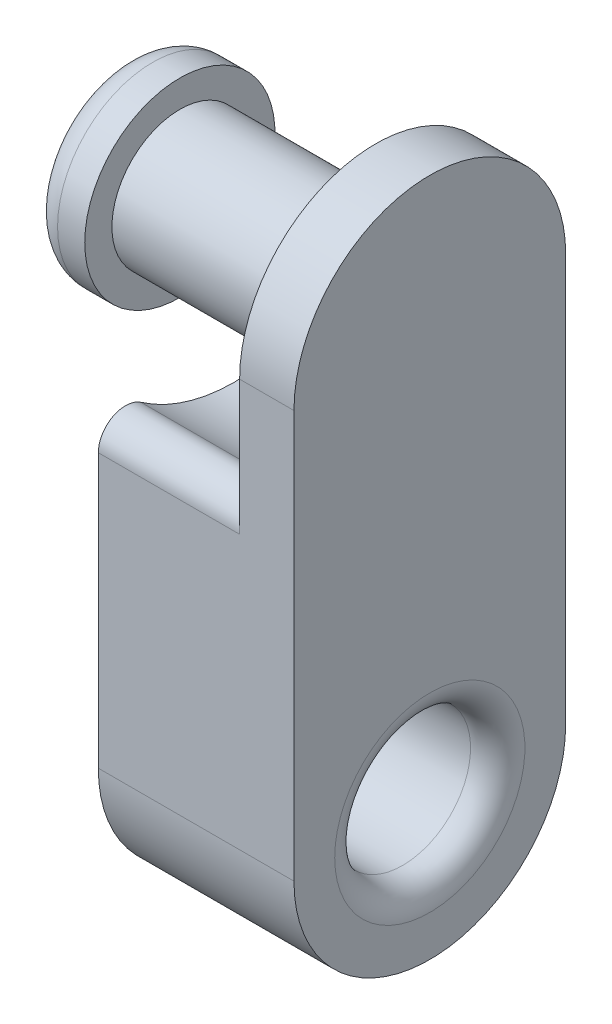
from build123d import *

# Parameters (mm, degrees)
SKETCH1_R           = 3.175
BOSS_EXTRUDE1_DEPTH = 2.54
BOSS_EXTRUDE2_START = -6.604
SKETCH1_4_R         = 3.175
BOSS_EXTRUDE2_DEPTH = 6.604
BOSS_EXTRUDE5_START = 2.54
SKETCH3_R           = 3.175
BOSS_EXTRUDE5_DEPTH = 2.54
BOSS_EXTRUDE6_START = 2.54
SKETCH3_3_R         = 4.445
BOSS_EXTRUDE6_DEPTH = 2.54
FILLET2_R           = 1.27


with BuildPart() as part:
    # Sketch1 → Boss-Extrude1 (new body)
    with BuildSketch(Plane(origin=(0, 0, 0), x_dir=(0, 0, -1), z_dir=(1, 0, 0))):
        with BuildLine():
            Line((-6.35, 0), (-6.35, 19.05))
            ThreePointArc((-6.35, 19.05), (0, 25.4), (6.35, 19.05))
            Line((6.35, 19.05), (6.35, 0))
            ThreePointArc((6.35, 0), (0, -6.35), (-6.35, 0))
        make_face()
        Circle(SKETCH1_R, mode=Mode.SUBTRACT)
    extrude(amount=BOSS_EXTRUDE1_DEPTH)

    # Sketch1_4 → Boss-Extrude2 (add)
    # profile 1 of 2: a face of its own
    with BuildSketch(Plane(origin=(0, 0, 0), x_dir=(0, 0, -1), z_dir=(1, 0, 0)).offset(BOSS_EXTRUDE2_START)):
        with BuildLine():
            Line((-6.35, 15.853886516), (-6.35, 0))
            ThreePointArc((-6.35, 0), (0, -6.35), (6.35, 0))
            Line((6.35, 0), (6.35, 15.853886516))
            ThreePointArc((6.35, 15.853886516), (0, 12.446), (-6.35, 15.853886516))
        make_face()
        Circle(SKETCH1_4_R, mode=Mode.SUBTRACT)
    # profile 2 of 2: a face of its own
    with BuildSketch(Plane(origin=(0, 0, 0), x_dir=(0, 0, -1), z_dir=(1, 0, 0)).offset(BOSS_EXTRUDE2_START)):
        with Locations((0, 19.05)):
            Circle(SKETCH1_4_R)
    extrude(amount=BOSS_EXTRUDE2_DEPTH)

    # Sketch3 → Boss-Extrude5 (add)
    with BuildSketch(Plane.ZY.offset(6.604).offset(BOSS_EXTRUDE5_START)):
        with Locations(Location((0, 19.05, 0), (0, 0, 180))):
            Circle(SKETCH3_R)
    extrude(amount=-BOSS_EXTRUDE5_DEPTH)

    # Sketch3_3 → Boss-Extrude6 (add)
    with BuildSketch(Plane.ZY.offset(6.604).offset(BOSS_EXTRUDE6_START)):
        with Locations((0, 19.05)):
            Circle(SKETCH3_3_R)
    extrude(amount=BOSS_EXTRUDE6_DEPTH)

    # Fillet2
    fillet2_edges = [part.edges().sort_by_distance(p)[0] for p in [
        (2.54, 0, 3.175),
        (-3.302, 15.853886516, 6.35),
        (-3.302, 15.853886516, -6.35),
        (-6.604, 0, 3.175),
        (-11.684, 19.05, -4.445),
    ]]
    fillet(fillet2_edges, radius=FILLET2_R)


solid = part.part
